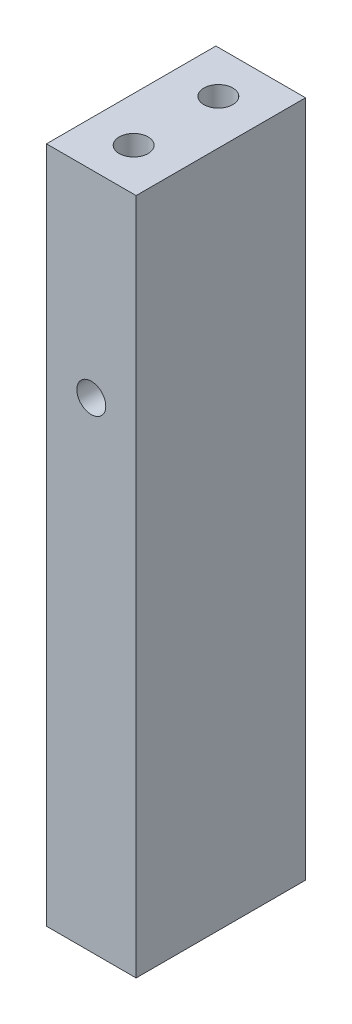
ISO-10303-21;
HEADER;
FILE_DESCRIPTION(('STEP AP214'),'2;1');
FILE_NAME('part.step','',(''),(''),'','','');
FILE_SCHEMA(('AUTOMOTIVE_DESIGN { 1 0 10303 214 1 1 1 1 }'));
ENDSEC;
DATA;
#1=APPLICATION_CONTEXT('core data for automotive mechanical design processes');
#2=APPLICATION_PROTOCOL_DEFINITION('international standard','automotive_design',2000,#1);
#3=PRODUCT_CONTEXT('',#1,'mechanical');
#4=PRODUCT('Part','Part','',(#3));
#5=PRODUCT_RELATED_PRODUCT_CATEGORY('part','',(#4));
#6=PRODUCT_DEFINITION_FORMATION('','',#4);
#7=PRODUCT_DEFINITION_CONTEXT('part definition',#1,'design');
#8=PRODUCT_DEFINITION('design','',#6,#7);
#9=PRODUCT_DEFINITION_SHAPE('','',#8);
#10=(LENGTH_UNIT() NAMED_UNIT(*) SI_UNIT(.MILLI.,.METRE.));
#11=(NAMED_UNIT(*) PLANE_ANGLE_UNIT() SI_UNIT($,.RADIAN.));
#12=(NAMED_UNIT(*) SI_UNIT($,.STERADIAN.) SOLID_ANGLE_UNIT());
#13=UNCERTAINTY_MEASURE_WITH_UNIT(LENGTH_MEASURE(1.E-05),#10,'distance_accuracy_value','');
#14=(GEOMETRIC_REPRESENTATION_CONTEXT(3) GLOBAL_UNCERTAINTY_ASSIGNED_CONTEXT((#13)) GLOBAL_UNIT_ASSIGNED_CONTEXT((#10,
#11,#12)) REPRESENTATION_CONTEXT('',''));
#15=CARTESIAN_POINT('',(0.,0.,0.));
#16=DIRECTION('',(0.,0.,1.));
#17=DIRECTION('',(1.,0.,0.));
#18=AXIS2_PLACEMENT_3D('',#15,#16,#17);
#19=CARTESIAN_POINT('',(0.,0.,12.));
#20=DIRECTION('',(1.,0.,0.));
#21=DIRECTION('',(0.,0.,-1.));
#22=AXIS2_PLACEMENT_3D('',#19,#20,#21);
#23=PLANE('',#22);
#24=DIRECTION('',(0.,-1.,0.));
#25=VECTOR('',#24,1.);
#26=CARTESIAN_POINT('',(0.,0.,0.));
#27=LINE('',#26,#25);
#28=CARTESIAN_POINT('',(0.,48.,0.));
#29=VERTEX_POINT('',#28);
#30=CARTESIAN_POINT('',(0.,0.,0.));
#31=VERTEX_POINT('',#30);
#32=EDGE_CURVE('E144',#29,#31,#27,.T.);
#33=ORIENTED_EDGE('',*,*,#32,.T.);
#34=DIRECTION('',(0.,0.,-1.));
#35=VECTOR('',#34,1.);
#36=CARTESIAN_POINT('',(0.,0.,12.));
#37=LINE('',#36,#35);
#38=CARTESIAN_POINT('',(0.,0.,12.));
#39=VERTEX_POINT('',#38);
#40=EDGE_CURVE('E11',#39,#31,#37,.T.);
#41=ORIENTED_EDGE('',*,*,#40,.F.);
#42=DIRECTION('',(0.,-1.,0.));
#43=VECTOR('',#42,1.);
#44=CARTESIAN_POINT('',(0.,0.,12.));
#45=LINE('',#44,#43);
#46=CARTESIAN_POINT('',(0.,48.,12.));
#47=VERTEX_POINT('',#46);
#48=EDGE_CURVE('E145',#47,#39,#45,.T.);
#49=ORIENTED_EDGE('',*,*,#48,.F.);
#50=DIRECTION('',(0.,0.,-1.));
#51=VECTOR('',#50,1.);
#52=CARTESIAN_POINT('',(0.,48.,12.));
#53=LINE('',#52,#51);
#54=EDGE_CURVE('E151',#47,#29,#53,.T.);
#55=ORIENTED_EDGE('',*,*,#54,.T.);
#56=EDGE_LOOP('',(#33,#41,#49,#55));
#57=FACE_BOUND('',#56,.T.);
#58=ADVANCED_FACE('F42',(#57),#23,.F.);
#59=CARTESIAN_POINT('',(0.,0.,12.));
#60=DIRECTION('',(0.,1.,0.));
#61=DIRECTION('',(0.,0.,1.));
#62=AXIS2_PLACEMENT_3D('',#59,#60,#61);
#63=PLANE('',#62);
#64=CARTESIAN_POINT('',(3.175,0.,9.));
#65=DIRECTION('',(0.,-1.,0.));
#66=DIRECTION('',(0.,0.,-1.));
#67=AXIS2_PLACEMENT_3D('',#64,#65,#66);
#68=CIRCLE('',#67,1.02499999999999);
#69=CARTESIAN_POINT('',(3.175,0.,7.97500000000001));
#70=VERTEX_POINT('',#69);
#71=EDGE_CURVE('E132',#70,#70,#68,.T.);
#72=ORIENTED_EDGE('',*,*,#71,.F.);
#73=EDGE_LOOP('',(#72));
#74=FACE_BOUND('',#73,.T.);
#75=CARTESIAN_POINT('',(3.175,0.,3.));
#76=DIRECTION('',(0.,-1.,0.));
#77=DIRECTION('',(0.,0.,-1.));
#78=AXIS2_PLACEMENT_3D('',#75,#76,#77);
#79=CIRCLE('',#78,1.02499999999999);
#80=CARTESIAN_POINT('',(3.175,0.,1.97500000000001));
#81=VERTEX_POINT('',#80);
#82=EDGE_CURVE('E138',#81,#81,#79,.T.);
#83=ORIENTED_EDGE('',*,*,#82,.F.);
#84=EDGE_LOOP('',(#83));
#85=FACE_BOUND('',#84,.T.);
#86=DIRECTION('',(1.,0.,0.));
#87=VECTOR('',#86,1.);
#88=CARTESIAN_POINT('',(0.,0.,0.));
#89=LINE('',#88,#87);
#90=CARTESIAN_POINT('',(6.35,0.,0.));
#91=VERTEX_POINT('',#90);
#92=EDGE_CURVE('E154',#31,#91,#89,.T.);
#93=ORIENTED_EDGE('',*,*,#92,.T.);
#94=DIRECTION('',(0.,0.,-1.));
#95=VECTOR('',#94,1.);
#96=CARTESIAN_POINT('',(6.35,0.,12.));
#97=LINE('',#96,#95);
#98=CARTESIAN_POINT('',(6.35,0.,12.));
#99=VERTEX_POINT('',#98);
#100=EDGE_CURVE('E50',#99,#91,#97,.T.);
#101=ORIENTED_EDGE('',*,*,#100,.F.);
#102=DIRECTION('',(1.,0.,0.));
#103=VECTOR('',#102,1.);
#104=CARTESIAN_POINT('',(0.,0.,12.));
#105=LINE('',#104,#103);
#106=EDGE_CURVE('E89',#39,#99,#105,.T.);
#107=ORIENTED_EDGE('',*,*,#106,.F.);
#108=ORIENTED_EDGE('',*,*,#40,.T.);
#109=EDGE_LOOP('',(#93,#101,#107,#108));
#110=FACE_BOUND('',#109,.T.);
#111=ADVANCED_FACE('F179',(#74,#85,#110),#63,.F.);
#112=CARTESIAN_POINT('',(6.35,0.,12.));
#113=DIRECTION('',(-1.,0.,0.));
#114=DIRECTION('',(0.,-1.,0.));
#115=AXIS2_PLACEMENT_3D('',#112,#113,#114);
#116=PLANE('',#115);
#117=DIRECTION('',(0.,1.,0.));
#118=VECTOR('',#117,1.);
#119=CARTESIAN_POINT('',(6.35,0.,0.));
#120=LINE('',#119,#118);
#121=CARTESIAN_POINT('',(6.35,48.,0.));
#122=VERTEX_POINT('',#121);
#123=EDGE_CURVE('E76',#91,#122,#120,.T.);
#124=ORIENTED_EDGE('',*,*,#123,.T.);
#125=DIRECTION('',(0.,0.,-1.));
#126=VECTOR('',#125,1.);
#127=CARTESIAN_POINT('',(6.35,48.,12.));
#128=LINE('',#127,#126);
#129=CARTESIAN_POINT('',(6.35,48.,12.));
#130=VERTEX_POINT('',#129);
#131=EDGE_CURVE('E159',#130,#122,#128,.T.);
#132=ORIENTED_EDGE('',*,*,#131,.F.);
#133=DIRECTION('',(0.,1.,0.));
#134=VECTOR('',#133,1.);
#135=CARTESIAN_POINT('',(6.35,0.,12.));
#136=LINE('',#135,#134);
#137=EDGE_CURVE('E148',#99,#130,#136,.T.);
#138=ORIENTED_EDGE('',*,*,#137,.F.);
#139=ORIENTED_EDGE('',*,*,#100,.T.);
#140=EDGE_LOOP('',(#124,#132,#138,#139));
#141=FACE_BOUND('',#140,.T.);
#142=ADVANCED_FACE('F161',(#141),#116,.F.);
#143=CARTESIAN_POINT('',(0.,48.,12.));
#144=DIRECTION('',(0.,-1.,0.));
#145=DIRECTION('',(0.,0.,-1.));
#146=AXIS2_PLACEMENT_3D('',#143,#144,#145);
#147=PLANE('',#146);
#148=CARTESIAN_POINT('',(3.175,48.,3.));
#149=DIRECTION('',(0.,1.,0.));
#150=DIRECTION('',(0.,0.,1.));
#151=AXIS2_PLACEMENT_3D('',#148,#149,#150);
#152=CIRCLE('',#151,1.02499999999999);
#153=CARTESIAN_POINT('',(3.175,48.,4.02499999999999));
#154=VERTEX_POINT('',#153);
#155=EDGE_CURVE('E115',#154,#154,#152,.T.);
#156=ORIENTED_EDGE('',*,*,#155,.F.);
#157=EDGE_LOOP('',(#156));
#158=FACE_BOUND('',#157,.T.);
#159=CARTESIAN_POINT('',(3.175,48.,9.));
#160=DIRECTION('',(0.,1.,0.));
#161=DIRECTION('',(0.,0.,1.));
#162=AXIS2_PLACEMENT_3D('',#159,#160,#161);
#163=CIRCLE('',#162,1.02499999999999);
#164=CARTESIAN_POINT('',(3.175,48.,10.025));
#165=VERTEX_POINT('',#164);
#166=EDGE_CURVE('E126',#165,#165,#163,.T.);
#167=ORIENTED_EDGE('',*,*,#166,.F.);
#168=EDGE_LOOP('',(#167));
#169=FACE_BOUND('',#168,.T.);
#170=DIRECTION('',(-1.,0.,0.));
#171=VECTOR('',#170,1.);
#172=CARTESIAN_POINT('',(0.,48.,0.));
#173=LINE('',#172,#171);
#174=EDGE_CURVE('E82',#122,#29,#173,.T.);
#175=ORIENTED_EDGE('',*,*,#174,.T.);
#176=ORIENTED_EDGE('',*,*,#54,.F.);
#177=DIRECTION('',(-1.,0.,0.));
#178=VECTOR('',#177,1.);
#179=CARTESIAN_POINT('',(0.,48.,12.));
#180=LINE('',#179,#178);
#181=EDGE_CURVE('E58',#130,#47,#180,.T.);
#182=ORIENTED_EDGE('',*,*,#181,.F.);
#183=ORIENTED_EDGE('',*,*,#131,.T.);
#184=EDGE_LOOP('',(#175,#176,#182,#183));
#185=FACE_BOUND('',#184,.T.);
#186=ADVANCED_FACE('F168',(#158,#169,#185),#147,.F.);
#187=CARTESIAN_POINT('',(0.,0.,12.));
#188=DIRECTION('',(0.,0.,-1.));
#189=DIRECTION('',(-1.,0.,0.));
#190=AXIS2_PLACEMENT_3D('',#187,#188,#189);
#191=PLANE('',#190);
#192=CARTESIAN_POINT('',(3.175,34.,12.));
#193=DIRECTION('',(0.,0.,1.));
#194=DIRECTION('',(1.,0.,0.));
#195=AXIS2_PLACEMENT_3D('',#192,#193,#194);
#196=CIRCLE('',#195,1.02499999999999);
#197=CARTESIAN_POINT('',(4.19999999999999,34.,12.));
#198=VERTEX_POINT('',#197);
#199=EDGE_CURVE('E116',#198,#198,#196,.T.);
#200=ORIENTED_EDGE('',*,*,#199,.F.);
#201=EDGE_LOOP('',(#200));
#202=FACE_BOUND('',#201,.T.);
#203=ORIENTED_EDGE('',*,*,#48,.T.);
#204=ORIENTED_EDGE('',*,*,#106,.T.);
#205=ORIENTED_EDGE('',*,*,#137,.T.);
#206=ORIENTED_EDGE('',*,*,#181,.T.);
#207=EDGE_LOOP('',(#203,#204,#205,#206));
#208=FACE_BOUND('',#207,.T.);
#209=ADVANCED_FACE('F170',(#202,#208),#191,.F.);
#210=CARTESIAN_POINT('',(0.,0.,0.));
#211=DIRECTION('',(0.,0.,-1.));
#212=DIRECTION('',(-1.,0.,0.));
#213=AXIS2_PLACEMENT_3D('',#210,#211,#212);
#214=PLANE('',#213);
#215=ORIENTED_EDGE('',*,*,#32,.F.);
#216=ORIENTED_EDGE('',*,*,#174,.F.);
#217=ORIENTED_EDGE('',*,*,#123,.F.);
#218=ORIENTED_EDGE('',*,*,#92,.F.);
#219=EDGE_LOOP('',(#215,#216,#217,#218));
#220=FACE_BOUND('',#219,.T.);
#221=ADVANCED_FACE('F164',(#220),#214,.T.);
#222=CARTESIAN_POINT('',(3.175,10.,3.));
#223=DIRECTION('',(0.,-1.,0.));
#224=DIRECTION('',(0.,0.,-1.));
#225=AXIS2_PLACEMENT_3D('',#222,#223,#224);
#226=CONICAL_SURFACE('',#225,1.02499999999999,1.02974425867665);
#227=CARTESIAN_POINT('',(3.175,10.6158821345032,3.));
#228=VERTEX_POINT('',#227);
#229=VERTEX_LOOP('',#228);
#230=FACE_BOUND('',#229,.T.);
#231=CARTESIAN_POINT('',(3.175,10.,3.));
#232=DIRECTION('',(0.,-1.,0.));
#233=DIRECTION('',(0.,0.,-1.));
#234=AXIS2_PLACEMENT_3D('',#231,#232,#233);
#235=CIRCLE('',#234,1.02499999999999);
#236=CARTESIAN_POINT('',(3.175,10.,1.97500000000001));
#237=VERTEX_POINT('',#236);
#238=EDGE_CURVE('E141',#237,#237,#235,.T.);
#239=ORIENTED_EDGE('',*,*,#238,.T.);
#240=EDGE_LOOP('',(#239));
#241=FACE_BOUND('',#240,.T.);
#242=ADVANCED_FACE('F198',(#230,#241),#226,.F.);
#243=CARTESIAN_POINT('',(3.175,0.,3.));
#244=DIRECTION('',(0.,-1.,0.));
#245=DIRECTION('',(0.,0.,-1.));
#246=AXIS2_PLACEMENT_3D('',#243,#244,#245);
#247=CYLINDRICAL_SURFACE('',#246,1.02499999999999);
#248=ORIENTED_EDGE('',*,*,#238,.F.);
#249=EDGE_LOOP('',(#248));
#250=FACE_BOUND('',#249,.T.);
#251=ORIENTED_EDGE('',*,*,#82,.T.);
#252=EDGE_LOOP('',(#251));
#253=FACE_BOUND('',#252,.T.);
#254=ADVANCED_FACE('F195',(#250,#253),#247,.F.);
#255=CARTESIAN_POINT('',(3.175,10.,9.));
#256=DIRECTION('',(0.,-1.,0.));
#257=DIRECTION('',(0.,0.,-1.));
#258=AXIS2_PLACEMENT_3D('',#255,#256,#257);
#259=CONICAL_SURFACE('',#258,1.02499999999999,1.02974425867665);
#260=CARTESIAN_POINT('',(3.175,10.6158821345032,9.));
#261=VERTEX_POINT('',#260);
#262=VERTEX_LOOP('',#261);
#263=FACE_BOUND('',#262,.T.);
#264=CARTESIAN_POINT('',(3.175,10.,9.));
#265=DIRECTION('',(0.,-1.,0.));
#266=DIRECTION('',(0.,0.,-1.));
#267=AXIS2_PLACEMENT_3D('',#264,#265,#266);
#268=CIRCLE('',#267,1.02499999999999);
#269=CARTESIAN_POINT('',(3.175,10.,7.97500000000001));
#270=VERTEX_POINT('',#269);
#271=EDGE_CURVE('E135',#270,#270,#268,.T.);
#272=ORIENTED_EDGE('',*,*,#271,.T.);
#273=EDGE_LOOP('',(#272));
#274=FACE_BOUND('',#273,.T.);
#275=ADVANCED_FACE('F197',(#263,#274),#259,.F.);
#276=CARTESIAN_POINT('',(3.175,0.,9.));
#277=DIRECTION('',(0.,-1.,0.));
#278=DIRECTION('',(0.,0.,-1.));
#279=AXIS2_PLACEMENT_3D('',#276,#277,#278);
#280=CYLINDRICAL_SURFACE('',#279,1.02499999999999);
#281=ORIENTED_EDGE('',*,*,#271,.F.);
#282=EDGE_LOOP('',(#281));
#283=FACE_BOUND('',#282,.T.);
#284=ORIENTED_EDGE('',*,*,#71,.T.);
#285=EDGE_LOOP('',(#284));
#286=FACE_BOUND('',#285,.T.);
#287=ADVANCED_FACE('F205',(#283,#286),#280,.F.);
#288=CARTESIAN_POINT('',(3.175,38.6158821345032,9.));
#289=DIRECTION('',(0.,1.,0.));
#290=DIRECTION('',(0.,0.,1.));
#291=AXIS2_PLACEMENT_3D('',#288,#289,#290);
#292=CONICAL_SURFACE('',#291,1.025,1.02974425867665);
#293=CARTESIAN_POINT('',(3.175,38.,9.));
#294=VERTEX_POINT('',#293);
#295=VERTEX_LOOP('',#294);
#296=FACE_BOUND('',#295,.T.);
#297=CARTESIAN_POINT('',(3.175,38.6158821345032,9.));
#298=DIRECTION('',(0.,1.,0.));
#299=DIRECTION('',(0.,0.,1.));
#300=AXIS2_PLACEMENT_3D('',#297,#298,#299);
#301=CIRCLE('',#300,1.025);
#302=CARTESIAN_POINT('',(3.175,38.6158821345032,10.025));
#303=VERTEX_POINT('',#302);
#304=EDGE_CURVE('E129',#303,#303,#301,.T.);
#305=ORIENTED_EDGE('',*,*,#304,.T.);
#306=EDGE_LOOP('',(#305));
#307=FACE_BOUND('',#306,.T.);
#308=ADVANCED_FACE('F250',(#296,#307),#292,.F.);
#309=CARTESIAN_POINT('',(3.175,48.,9.));
#310=DIRECTION('',(0.,1.,0.));
#311=DIRECTION('',(0.,0.,1.));
#312=AXIS2_PLACEMENT_3D('',#309,#310,#311);
#313=CYLINDRICAL_SURFACE('',#312,1.02499999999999);
#314=ORIENTED_EDGE('',*,*,#304,.F.);
#315=EDGE_LOOP('',(#314));
#316=FACE_BOUND('',#315,.T.);
#317=ORIENTED_EDGE('',*,*,#166,.T.);
#318=EDGE_LOOP('',(#317));
#319=FACE_BOUND('',#318,.T.);
#320=ADVANCED_FACE('F272',(#316,#319),#313,.F.);
#321=CARTESIAN_POINT('',(3.175,38.6158821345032,3.));
#322=DIRECTION('',(0.,1.,0.));
#323=DIRECTION('',(0.,0.,1.));
#324=AXIS2_PLACEMENT_3D('',#321,#322,#323);
#325=CONICAL_SURFACE('',#324,1.025,1.02974425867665);
#326=CARTESIAN_POINT('',(3.175,38.,3.));
#327=VERTEX_POINT('',#326);
#328=VERTEX_LOOP('',#327);
#329=FACE_BOUND('',#328,.T.);
#330=CARTESIAN_POINT('',(3.175,38.6158821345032,3.));
#331=DIRECTION('',(0.,1.,0.));
#332=DIRECTION('',(0.,0.,1.));
#333=AXIS2_PLACEMENT_3D('',#330,#331,#332);
#334=CIRCLE('',#333,1.025);
#335=CARTESIAN_POINT('',(3.175,38.6158821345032,4.025));
#336=VERTEX_POINT('',#335);
#337=EDGE_CURVE('E119',#336,#336,#334,.T.);
#338=ORIENTED_EDGE('',*,*,#337,.T.);
#339=EDGE_LOOP('',(#338));
#340=FACE_BOUND('',#339,.T.);
#341=ADVANCED_FACE('F282',(#329,#340),#325,.F.);
#342=CARTESIAN_POINT('',(3.175,48.,3.));
#343=DIRECTION('',(0.,1.,0.));
#344=DIRECTION('',(0.,0.,1.));
#345=AXIS2_PLACEMENT_3D('',#342,#343,#344);
#346=CYLINDRICAL_SURFACE('',#345,1.02499999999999);
#347=ORIENTED_EDGE('',*,*,#337,.F.);
#348=EDGE_LOOP('',(#347));
#349=FACE_BOUND('',#348,.T.);
#350=ORIENTED_EDGE('',*,*,#155,.T.);
#351=EDGE_LOOP('',(#350));
#352=FACE_BOUND('',#351,.T.);
#353=ADVANCED_FACE('F109',(#349,#352),#346,.F.);
#354=CARTESIAN_POINT('',(3.175,34.,2.61588213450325));
#355=DIRECTION('',(0.,0.,1.));
#356=DIRECTION('',(1.,0.,0.));
#357=AXIS2_PLACEMENT_3D('',#354,#355,#356);
#358=CONICAL_SURFACE('',#357,1.025,1.02974425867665);
#359=CARTESIAN_POINT('',(3.17499999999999,34.,2.));
#360=VERTEX_POINT('',#359);
#361=VERTEX_LOOP('',#360);
#362=FACE_BOUND('',#361,.T.);
#363=CARTESIAN_POINT('',(3.175,34.,2.61588213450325));
#364=DIRECTION('',(0.,0.,1.));
#365=DIRECTION('',(1.,0.,0.));
#366=AXIS2_PLACEMENT_3D('',#363,#364,#365);
#367=CIRCLE('',#366,1.025);
#368=CARTESIAN_POINT('',(4.19999999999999,34.,2.61588213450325));
#369=VERTEX_POINT('',#368);
#370=EDGE_CURVE('E113',#369,#369,#367,.T.);
#371=ORIENTED_EDGE('',*,*,#370,.T.);
#372=EDGE_LOOP('',(#371));
#373=FACE_BOUND('',#372,.T.);
#374=ADVANCED_FACE('F105',(#362,#373),#358,.F.);
#375=CARTESIAN_POINT('',(3.175,34.,12.));
#376=DIRECTION('',(0.,0.,1.));
#377=DIRECTION('',(1.,0.,0.));
#378=AXIS2_PLACEMENT_3D('',#375,#376,#377);
#379=CYLINDRICAL_SURFACE('',#378,1.02499999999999);
#380=ORIENTED_EDGE('',*,*,#370,.F.);
#381=EDGE_LOOP('',(#380));
#382=FACE_BOUND('',#381,.T.);
#383=ORIENTED_EDGE('',*,*,#199,.T.);
#384=EDGE_LOOP('',(#383));
#385=FACE_BOUND('',#384,.T.);
#386=ADVANCED_FACE('F108',(#382,#385),#379,.F.);
#387=CLOSED_SHELL('',(#58,#111,#142,#186,#209,#221,#242,#254,#275,#287,#308,#320,#341,#353,#374,#386));
#388=MANIFOLD_SOLID_BREP('B2',#387);
#389=ADVANCED_BREP_SHAPE_REPRESENTATION('',(#18,#388),#14);
#390=SHAPE_DEFINITION_REPRESENTATION(#9,#389);
ENDSEC;
END-ISO-10303-21;
